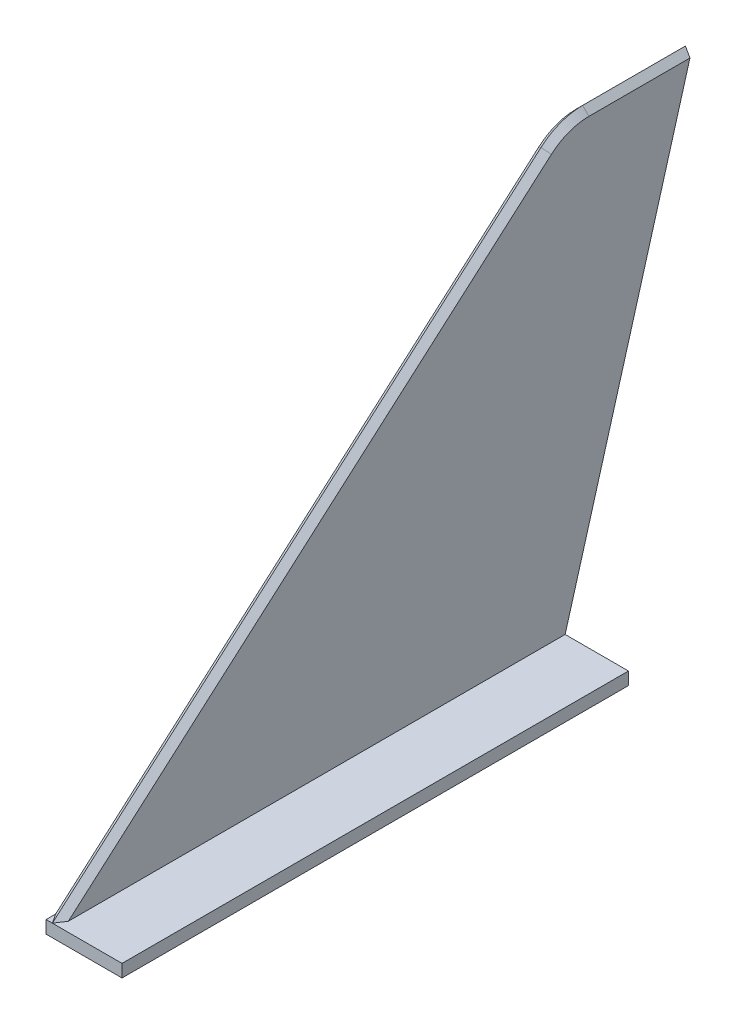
ISO-10303-21;
HEADER;
FILE_DESCRIPTION(('STEP AP214'),'2;1');
FILE_NAME('part.step','',(''),(''),'','','');
FILE_SCHEMA(('AUTOMOTIVE_DESIGN { 1 0 10303 214 1 1 1 1 }'));
ENDSEC;
DATA;
#1=APPLICATION_CONTEXT('core data for automotive mechanical design processes');
#2=APPLICATION_PROTOCOL_DEFINITION('international standard','automotive_design',2000,#1);
#3=PRODUCT_CONTEXT('',#1,'mechanical');
#4=PRODUCT('Part','Part','',(#3));
#5=PRODUCT_RELATED_PRODUCT_CATEGORY('part','',(#4));
#6=PRODUCT_DEFINITION_FORMATION('','',#4);
#7=PRODUCT_DEFINITION_CONTEXT('part definition',#1,'design');
#8=PRODUCT_DEFINITION('design','',#6,#7);
#9=PRODUCT_DEFINITION_SHAPE('','',#8);
#10=(LENGTH_UNIT() NAMED_UNIT(*) SI_UNIT(.MILLI.,.METRE.));
#11=(NAMED_UNIT(*) PLANE_ANGLE_UNIT() SI_UNIT($,.RADIAN.));
#12=(NAMED_UNIT(*) SI_UNIT($,.STERADIAN.) SOLID_ANGLE_UNIT());
#13=UNCERTAINTY_MEASURE_WITH_UNIT(LENGTH_MEASURE(1.E-05),#10,'distance_accuracy_value','');
#14=(GEOMETRIC_REPRESENTATION_CONTEXT(3) GLOBAL_UNCERTAINTY_ASSIGNED_CONTEXT((#13)) GLOBAL_UNIT_ASSIGNED_CONTEXT((#10,
#11,#12)) REPRESENTATION_CONTEXT('',''));
#15=CARTESIAN_POINT('',(0.,0.,0.));
#16=DIRECTION('',(0.,0.,1.));
#17=DIRECTION('',(1.,0.,0.));
#18=AXIS2_PLACEMENT_3D('',#15,#16,#17);
#19=CARTESIAN_POINT('',(1.,70.,-20.));
#20=DIRECTION('',(0.,0.274721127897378,0.961523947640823));
#21=DIRECTION('',(0.,-0.961523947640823,0.274721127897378));
#22=AXIS2_PLACEMENT_3D('',#19,#20,#21);
#23=PLANE('',#22);
#24=DIRECTION('',(0.,0.961523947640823,-0.274721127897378));
#25=VECTOR('',#24,1.);
#26=CARTESIAN_POINT('',(-1.,70.,-20.));
#27=LINE('',#26,#25);
#28=CARTESIAN_POINT('',(-1.,0.,0.));
#29=VERTEX_POINT('',#28);
#30=CARTESIAN_POINT('',(-1.,69.,-19.7142857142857));
#31=VERTEX_POINT('',#30);
#32=EDGE_CURVE('E125',#29,#31,#27,.T.);
#33=ORIENTED_EDGE('',*,*,#32,.T.);
#34=DIRECTION('',(0.693103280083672,0.693103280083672,-0.198029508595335));
#35=VECTOR('',#34,1.);
#36=CARTESIAN_POINT('',(-2.2293831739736,67.7706168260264,-19.3630333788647));
#37=LINE('',#36,#35);
#38=CARTESIAN_POINT('',(0.,70.,-20.));
#39=VERTEX_POINT('',#38);
#40=EDGE_CURVE('E164',#31,#39,#37,.T.);
#41=ORIENTED_EDGE('',*,*,#40,.T.);
#42=DIRECTION('',(-0.693103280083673,0.693103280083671,-0.198029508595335));
#43=VECTOR('',#42,1.);
#44=CARTESIAN_POINT('',(3.19016748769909,66.8098325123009,-19.0885235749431));
#45=LINE('',#44,#43);
#46=CARTESIAN_POINT('',(1.,69.,-19.7142857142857));
#47=VERTEX_POINT('',#46);
#48=EDGE_CURVE('E163',#39,#47,#45,.F.);
#49=ORIENTED_EDGE('',*,*,#48,.T.);
#50=DIRECTION('',(0.,0.961523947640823,-0.274721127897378));
#51=VECTOR('',#50,1.);
#52=CARTESIAN_POINT('',(1.,70.,-20.));
#53=LINE('',#52,#51);
#54=CARTESIAN_POINT('',(1.,0.,0.));
#55=VERTEX_POINT('',#54);
#56=EDGE_CURVE('E126',#55,#47,#53,.T.);
#57=ORIENTED_EDGE('',*,*,#56,.F.);
#58=DIRECTION('',(-1.,0.,0.));
#59=VECTOR('',#58,1.);
#60=CARTESIAN_POINT('',(1.,0.,0.));
#61=LINE('',#60,#59);
#62=EDGE_CURVE('E111',#55,#29,#61,.T.);
#63=ORIENTED_EDGE('',*,*,#62,.T.);
#64=EDGE_LOOP('',(#33,#41,#49,#57,#63));
#65=FACE_BOUND('',#64,.T.);
#66=ADVANCED_FACE('F31',(#65),#23,.F.);
#67=CARTESIAN_POINT('',(1.,60.,-3.75735116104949));
#68=DIRECTION('',(-1.,0.,0.));
#69=DIRECTION('',(0.,0.,1.));
#70=AXIS2_PLACEMENT_3D('',#67,#68,#69);
#71=PLANE('',#70);
#72=ORIENTED_EDGE('',*,*,#56,.T.);
#73=DIRECTION('',(0.,0.,1.));
#74=VECTOR('',#73,1.);
#75=CARTESIAN_POINT('',(1.,69.,-3.75735116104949));
#76=LINE('',#75,#74);
#77=CARTESIAN_POINT('',(1.,69.,-3.75735116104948));
#78=VERTEX_POINT('',#77);
#79=EDGE_CURVE('E11',#47,#78,#76,.T.);
#80=ORIENTED_EDGE('',*,*,#79,.T.);
#81=CARTESIAN_POINT('',(1.,60.,-3.75735116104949));
#82=DIRECTION('',(-1.,0.,0.));
#83=DIRECTION('',(0.,0.,1.));
#84=AXIS2_PLACEMENT_3D('',#81,#82,#83);
#85=CIRCLE('',#84,9.);
#86=CARTESIAN_POINT('',(1.,66.7731902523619,2.16919030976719));
#87=VERTEX_POINT('',#86);
#88=EDGE_CURVE('E39',#78,#87,#85,.F.);
#89=ORIENTED_EDGE('',*,*,#88,.T.);
#90=DIRECTION('',(0.,-0.658504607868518,0.752576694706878));
#91=VECTOR('',#90,1.);
#92=CARTESIAN_POINT('',(1.,66.7731902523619,2.16919030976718));
#93=LINE('',#92,#91);
#94=CARTESIAN_POINT('',(1.,0.,78.4814077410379));
#95=VERTEX_POINT('',#94);
#96=EDGE_CURVE('E156',#87,#95,#93,.T.);
#97=ORIENTED_EDGE('',*,*,#96,.T.);
#98=DIRECTION('',(0.,0.,-1.));
#99=VECTOR('',#98,1.);
#100=CARTESIAN_POINT('',(1.,0.,0.));
#101=LINE('',#100,#99);
#102=EDGE_CURVE('E128',#95,#55,#101,.T.);
#103=ORIENTED_EDGE('',*,*,#102,.T.);
#104=EDGE_LOOP('',(#72,#80,#89,#97,#103));
#105=FACE_BOUND('',#104,.T.);
#106=ADVANCED_FACE('F170',(#105),#71,.F.);
#107=CARTESIAN_POINT('',(-1.,60.,-3.75735116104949));
#108=DIRECTION('',(-1.,0.,0.));
#109=DIRECTION('',(0.,0.,1.));
#110=AXIS2_PLACEMENT_3D('',#107,#108,#109);
#111=PLANE('',#110);
#112=CARTESIAN_POINT('',(-1.,60.,-3.75735116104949));
#113=DIRECTION('',(-1.,0.,0.));
#114=DIRECTION('',(0.,0.,1.));
#115=AXIS2_PLACEMENT_3D('',#112,#113,#114);
#116=CIRCLE('',#115,9.);
#117=CARTESIAN_POINT('',(-1.,66.7731902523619,2.16919030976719));
#118=VERTEX_POINT('',#117);
#119=CARTESIAN_POINT('',(-1.,69.,-3.75735116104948));
#120=VERTEX_POINT('',#119);
#121=EDGE_CURVE('E144',#118,#120,#116,.T.);
#122=ORIENTED_EDGE('',*,*,#121,.T.);
#123=DIRECTION('',(0.,0.,-1.));
#124=VECTOR('',#123,1.);
#125=CARTESIAN_POINT('',(-1.,69.,-20.));
#126=LINE('',#125,#124);
#127=EDGE_CURVE('E133',#120,#31,#126,.T.);
#128=ORIENTED_EDGE('',*,*,#127,.T.);
#129=ORIENTED_EDGE('',*,*,#32,.F.);
#130=DIRECTION('',(0.,1.,0.));
#131=VECTOR('',#130,1.);
#132=CARTESIAN_POINT('',(-1.,-2.,0.));
#133=LINE('',#132,#131);
#134=CARTESIAN_POINT('',(-1.,-2.,0.));
#135=VERTEX_POINT('',#134);
#136=EDGE_CURVE('E108',#135,#29,#133,.T.);
#137=ORIENTED_EDGE('',*,*,#136,.F.);
#138=DIRECTION('',(0.,0.,-1.));
#139=VECTOR('',#138,1.);
#140=CARTESIAN_POINT('',(-1.,-2.,0.));
#141=LINE('',#140,#139);
#142=CARTESIAN_POINT('',(-1.,-2.00000000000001,80.));
#143=VERTEX_POINT('',#142);
#144=EDGE_CURVE('E198',#143,#135,#141,.T.);
#145=ORIENTED_EDGE('',*,*,#144,.F.);
#146=DIRECTION('',(0.,1.,0.));
#147=VECTOR('',#146,1.);
#148=CARTESIAN_POINT('',(-1.,-2.00000000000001,80.));
#149=LINE('',#148,#147);
#150=CARTESIAN_POINT('',(-1.,0.,80.));
#151=VERTEX_POINT('',#150);
#152=EDGE_CURVE('E208',#143,#151,#149,.T.);
#153=ORIENTED_EDGE('',*,*,#152,.T.);
#154=DIRECTION('',(0.,0.,-1.));
#155=VECTOR('',#154,1.);
#156=CARTESIAN_POINT('',(-1.,0.,0.));
#157=LINE('',#156,#155);
#158=CARTESIAN_POINT('',(-1.,0.,78.4814077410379));
#159=VERTEX_POINT('',#158);
#160=EDGE_CURVE('E187',#151,#159,#157,.T.);
#161=ORIENTED_EDGE('',*,*,#160,.T.);
#162=DIRECTION('',(0.,0.658504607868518,-0.752576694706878));
#163=VECTOR('',#162,1.);
#164=CARTESIAN_POINT('',(-1.,66.7731902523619,2.16919030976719));
#165=LINE('',#164,#163);
#166=EDGE_CURVE('E127',#159,#118,#165,.T.);
#167=ORIENTED_EDGE('',*,*,#166,.T.);
#168=EDGE_LOOP('',(#122,#128,#129,#137,#145,#153,#161,#167));
#169=FACE_BOUND('',#168,.T.);
#170=ADVANCED_FACE('F131',(#169),#111,.T.);
#171=CARTESIAN_POINT('',(1.,66.7731902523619,2.16919030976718));
#172=DIRECTION('',(-0.707106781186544,-0.532152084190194,-0.46563307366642));
#173=DIRECTION('',(0.601316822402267,-0.799010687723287,0.));
#174=AXIS2_PLACEMENT_3D('',#171,#172,#173);
#175=PLANE('',#174);
#176=DIRECTION('',(0.549971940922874,0.,-0.835183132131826));
#177=VECTOR('',#176,1.);
#178=CARTESIAN_POINT('',(36.0522838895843,0.,25.2512807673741));
#179=LINE('',#178,#177);
#180=CARTESIAN_POINT('',(0.,0.,80.));
#181=VERTEX_POINT('',#180);
#182=EDGE_CURVE('E157',#95,#181,#179,.F.);
#183=ORIENTED_EDGE('',*,*,#182,.F.);
#184=ORIENTED_EDGE('',*,*,#96,.F.);
#185=DIRECTION('',(0.707106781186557,-0.532152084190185,-0.465633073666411));
#186=VECTOR('',#185,1.);
#187=CARTESIAN_POINT('',(0.,67.5257669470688,2.82769491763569));
#188=LINE('',#187,#186);
#189=CARTESIAN_POINT('',(0.,67.5257669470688,2.82769491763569));
#190=VERTEX_POINT('',#189);
#191=EDGE_CURVE('E134',#190,#87,#188,.T.);
#192=ORIENTED_EDGE('',*,*,#191,.F.);
#193=DIRECTION('',(0.,0.658504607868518,-0.752576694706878));
#194=VECTOR('',#193,1.);
#195=CARTESIAN_POINT('',(0.,0.,80.));
#196=LINE('',#195,#194);
#197=EDGE_CURVE('E138',#181,#190,#196,.T.);
#198=ORIENTED_EDGE('',*,*,#197,.F.);
#199=EDGE_LOOP('',(#183,#184,#192,#198));
#200=FACE_BOUND('',#199,.T.);
#201=ADVANCED_FACE('F173',(#200),#175,.F.);
#202=CARTESIAN_POINT('',(1.,60.,-3.75735116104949));
#203=DIRECTION('',(-1.,0.,0.));
#204=DIRECTION('',(0.,0.,1.));
#205=AXIS2_PLACEMENT_3D('',#202,#203,#204);
#206=CONICAL_SURFACE('',#205,9.,0.785398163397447);
#207=ORIENTED_EDGE('',*,*,#191,.T.);
#208=ORIENTED_EDGE('',*,*,#88,.F.);
#209=DIRECTION('',(0.707106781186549,-0.707106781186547,0.));
#210=VECTOR('',#209,1.);
#211=CARTESIAN_POINT('',(0.,70.,-3.75735116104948));
#212=LINE('',#211,#210);
#213=CARTESIAN_POINT('',(0.,70.,-3.75735116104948));
#214=VERTEX_POINT('',#213);
#215=EDGE_CURVE('E230',#214,#78,#212,.T.);
#216=ORIENTED_EDGE('',*,*,#215,.F.);
#217=CARTESIAN_POINT('',(0.,60.,-3.75735116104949));
#218=DIRECTION('',(-1.,0.,0.));
#219=DIRECTION('',(0.,0.,1.));
#220=AXIS2_PLACEMENT_3D('',#217,#218,#219);
#221=CIRCLE('',#220,10.);
#222=EDGE_CURVE('E227',#190,#214,#221,.T.);
#223=ORIENTED_EDGE('',*,*,#222,.F.);
#224=EDGE_LOOP('',(#207,#208,#216,#223));
#225=FACE_BOUND('',#224,.T.);
#226=ADVANCED_FACE('F236',(#225),#206,.T.);
#227=CARTESIAN_POINT('',(0.,0.,80.));
#228=DIRECTION('',(-0.707106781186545,0.532152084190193,0.465633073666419));
#229=DIRECTION('',(-0.601316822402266,-0.799010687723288,0.));
#230=AXIS2_PLACEMENT_3D('',#227,#228,#229);
#231=PLANE('',#230);
#232=DIRECTION('',(-0.549971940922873,0.,-0.835183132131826));
#233=VECTOR('',#232,1.);
#234=CARTESIAN_POINT('',(0.,0.,80.));
#235=LINE('',#234,#233);
#236=EDGE_CURVE('E154',#181,#159,#235,.T.);
#237=ORIENTED_EDGE('',*,*,#236,.F.);
#238=ORIENTED_EDGE('',*,*,#197,.T.);
#239=DIRECTION('',(0.707106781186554,0.532152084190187,0.465633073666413));
#240=VECTOR('',#239,1.);
#241=CARTESIAN_POINT('',(-1.,66.7731902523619,2.16919030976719));
#242=LINE('',#241,#240);
#243=EDGE_CURVE('E224',#118,#190,#242,.T.);
#244=ORIENTED_EDGE('',*,*,#243,.F.);
#245=ORIENTED_EDGE('',*,*,#166,.F.);
#246=EDGE_LOOP('',(#237,#238,#244,#245));
#247=FACE_BOUND('',#246,.T.);
#248=ADVANCED_FACE('F234',(#247),#231,.T.);
#249=CARTESIAN_POINT('',(1.,69.,-3.75735116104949));
#250=DIRECTION('',(-0.707106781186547,-0.707106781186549,0.));
#251=DIRECTION('',(0.707106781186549,-0.707106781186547,0.));
#252=AXIS2_PLACEMENT_3D('',#249,#250,#251);
#253=PLANE('',#252);
#254=ORIENTED_EDGE('',*,*,#79,.F.);
#255=ORIENTED_EDGE('',*,*,#48,.F.);
#256=DIRECTION('',(0.,0.,-1.));
#257=VECTOR('',#256,1.);
#258=CARTESIAN_POINT('',(0.,70.,-3.75735116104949));
#259=LINE('',#258,#257);
#260=EDGE_CURVE('E221',#214,#39,#259,.T.);
#261=ORIENTED_EDGE('',*,*,#260,.F.);
#262=ORIENTED_EDGE('',*,*,#215,.T.);
#263=EDGE_LOOP('',(#254,#255,#261,#262));
#264=FACE_BOUND('',#263,.T.);
#265=ADVANCED_FACE('F245',(#264),#253,.F.);
#266=CARTESIAN_POINT('',(0.,60.,-3.75735116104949));
#267=DIRECTION('',(1.,0.,0.));
#268=DIRECTION('',(0.,0.,-1.));
#269=AXIS2_PLACEMENT_3D('',#266,#267,#268);
#270=CONICAL_SURFACE('',#269,10.,0.785398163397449);
#271=ORIENTED_EDGE('',*,*,#243,.T.);
#272=ORIENTED_EDGE('',*,*,#222,.T.);
#273=DIRECTION('',(0.707106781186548,0.707106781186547,0.));
#274=VECTOR('',#273,1.);
#275=CARTESIAN_POINT('',(-1.,69.,-3.75735116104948));
#276=LINE('',#275,#274);
#277=EDGE_CURVE('E119',#120,#214,#276,.T.);
#278=ORIENTED_EDGE('',*,*,#277,.F.);
#279=ORIENTED_EDGE('',*,*,#121,.F.);
#280=EDGE_LOOP('',(#271,#272,#278,#279));
#281=FACE_BOUND('',#280,.T.);
#282=ADVANCED_FACE('F240',(#281),#270,.T.);
#283=CARTESIAN_POINT('',(0.,70.,-3.75735116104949));
#284=DIRECTION('',(-0.707106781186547,0.707106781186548,0.));
#285=DIRECTION('',(-0.707106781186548,-0.707106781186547,0.));
#286=AXIS2_PLACEMENT_3D('',#283,#284,#285);
#287=PLANE('',#286);
#288=ORIENTED_EDGE('',*,*,#40,.F.);
#289=ORIENTED_EDGE('',*,*,#127,.F.);
#290=ORIENTED_EDGE('',*,*,#277,.T.);
#291=ORIENTED_EDGE('',*,*,#260,.T.);
#292=EDGE_LOOP('',(#288,#289,#290,#291));
#293=FACE_BOUND('',#292,.T.);
#294=ADVANCED_FACE('F242',(#293),#287,.T.);
#295=CARTESIAN_POINT('',(-1.,0.,80.));
#296=DIRECTION('',(0.,1.,0.));
#297=DIRECTION('',(0.,0.,1.));
#298=AXIS2_PLACEMENT_3D('',#295,#296,#297);
#299=PLANE('',#298);
#300=DIRECTION('',(-1.,0.,0.));
#301=VECTOR('',#300,1.);
#302=CARTESIAN_POINT('',(-1.,0.,80.));
#303=LINE('',#302,#301);
#304=EDGE_CURVE('E185',#181,#151,#303,.T.);
#305=ORIENTED_EDGE('',*,*,#304,.F.);
#306=ORIENTED_EDGE('',*,*,#236,.T.);
#307=ORIENTED_EDGE('',*,*,#160,.F.);
#308=EDGE_LOOP('',(#305,#306,#307));
#309=FACE_BOUND('',#308,.T.);
#310=ADVANCED_FACE('F186',(#309),#299,.T.);
#311=CARTESIAN_POINT('',(-1.,-2.,0.));
#312=DIRECTION('',(0.,0.,1.));
#313=DIRECTION('',(0.,-1.,0.));
#314=AXIS2_PLACEMENT_3D('',#311,#312,#313);
#315=PLANE('',#314);
#316=ORIENTED_EDGE('',*,*,#62,.F.);
#317=DIRECTION('',(1.,0.,0.));
#318=VECTOR('',#317,1.);
#319=CARTESIAN_POINT('',(-1.,0.,0.));
#320=LINE('',#319,#318);
#321=CARTESIAN_POINT('',(11.,0.,0.));
#322=VERTEX_POINT('',#321);
#323=EDGE_CURVE('E215',#55,#322,#320,.T.);
#324=ORIENTED_EDGE('',*,*,#323,.T.);
#325=DIRECTION('',(0.,1.,0.));
#326=VECTOR('',#325,1.);
#327=CARTESIAN_POINT('',(11.,-2.,0.));
#328=LINE('',#327,#326);
#329=CARTESIAN_POINT('',(11.,-2.,0.));
#330=VERTEX_POINT('',#329);
#331=EDGE_CURVE('E120',#330,#322,#328,.T.);
#332=ORIENTED_EDGE('',*,*,#331,.F.);
#333=DIRECTION('',(1.,0.,0.));
#334=VECTOR('',#333,1.);
#335=CARTESIAN_POINT('',(-1.,-2.,0.));
#336=LINE('',#335,#334);
#337=EDGE_CURVE('E114',#135,#330,#336,.T.);
#338=ORIENTED_EDGE('',*,*,#337,.F.);
#339=ORIENTED_EDGE('',*,*,#136,.T.);
#340=EDGE_LOOP('',(#316,#324,#332,#338,#339));
#341=FACE_BOUND('',#340,.T.);
#342=ADVANCED_FACE('F110',(#341),#315,.F.);
#343=CARTESIAN_POINT('',(11.,-2.,0.));
#344=DIRECTION('',(-1.,0.,0.));
#345=DIRECTION('',(0.,0.,1.));
#346=AXIS2_PLACEMENT_3D('',#343,#344,#345);
#347=PLANE('',#346);
#348=DIRECTION('',(0.,0.,1.));
#349=VECTOR('',#348,1.);
#350=CARTESIAN_POINT('',(11.,0.,0.));
#351=LINE('',#350,#349);
#352=CARTESIAN_POINT('',(11.,0.,80.));
#353=VERTEX_POINT('',#352);
#354=EDGE_CURVE('E191',#322,#353,#351,.T.);
#355=ORIENTED_EDGE('',*,*,#354,.T.);
#356=DIRECTION('',(0.,1.,0.));
#357=VECTOR('',#356,1.);
#358=CARTESIAN_POINT('',(11.,-2.00000000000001,80.));
#359=LINE('',#358,#357);
#360=CARTESIAN_POINT('',(11.,-2.00000000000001,80.));
#361=VERTEX_POINT('',#360);
#362=EDGE_CURVE('E197',#361,#353,#359,.T.);
#363=ORIENTED_EDGE('',*,*,#362,.F.);
#364=DIRECTION('',(0.,0.,1.));
#365=VECTOR('',#364,1.);
#366=CARTESIAN_POINT('',(11.,-2.,0.));
#367=LINE('',#366,#365);
#368=EDGE_CURVE('E204',#330,#361,#367,.T.);
#369=ORIENTED_EDGE('',*,*,#368,.F.);
#370=ORIENTED_EDGE('',*,*,#331,.T.);
#371=EDGE_LOOP('',(#355,#363,#369,#370));
#372=FACE_BOUND('',#371,.T.);
#373=ADVANCED_FACE('F297',(#372),#347,.F.);
#374=CARTESIAN_POINT('',(-1.,-2.00000000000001,80.));
#375=DIRECTION('',(0.,0.,-1.));
#376=DIRECTION('',(0.,1.,0.));
#377=AXIS2_PLACEMENT_3D('',#374,#375,#376);
#378=PLANE('',#377);
#379=EDGE_CURVE('E182',#353,#181,#303,.T.);
#380=ORIENTED_EDGE('',*,*,#379,.T.);
#381=ORIENTED_EDGE('',*,*,#304,.T.);
#382=ORIENTED_EDGE('',*,*,#152,.F.);
#383=DIRECTION('',(-1.,0.,0.));
#384=VECTOR('',#383,1.);
#385=CARTESIAN_POINT('',(-1.,-2.00000000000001,80.));
#386=LINE('',#385,#384);
#387=EDGE_CURVE('E206',#361,#143,#386,.T.);
#388=ORIENTED_EDGE('',*,*,#387,.F.);
#389=ORIENTED_EDGE('',*,*,#362,.T.);
#390=EDGE_LOOP('',(#380,#381,#382,#388,#389));
#391=FACE_BOUND('',#390,.T.);
#392=ADVANCED_FACE('F194',(#391),#378,.F.);
#393=CARTESIAN_POINT('',(-1.,-2.00000000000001,80.));
#394=DIRECTION('',(0.,1.,0.));
#395=DIRECTION('',(0.,0.,1.));
#396=AXIS2_PLACEMENT_3D('',#393,#394,#395);
#397=PLANE('',#396);
#398=ORIENTED_EDGE('',*,*,#144,.T.);
#399=ORIENTED_EDGE('',*,*,#337,.T.);
#400=ORIENTED_EDGE('',*,*,#368,.T.);
#401=ORIENTED_EDGE('',*,*,#387,.T.);
#402=EDGE_LOOP('',(#398,#399,#400,#401));
#403=FACE_BOUND('',#402,.T.);
#404=ADVANCED_FACE('F315',(#403),#397,.F.);
#405=ORIENTED_EDGE('',*,*,#102,.F.);
#406=ORIENTED_EDGE('',*,*,#182,.T.);
#407=ORIENTED_EDGE('',*,*,#379,.F.);
#408=ORIENTED_EDGE('',*,*,#354,.F.);
#409=ORIENTED_EDGE('',*,*,#323,.F.);
#410=EDGE_LOOP('',(#405,#406,#407,#408,#409));
#411=FACE_BOUND('',#410,.T.);
#412=ADVANCED_FACE('F179',(#411),#299,.T.);
#413=CLOSED_SHELL('',(#66,#106,#170,#201,#226,#248,#265,#282,#294,#310,#342,#373,#392,#404,#412));
#414=MANIFOLD_SOLID_BREP('B2',#413);
#415=ADVANCED_BREP_SHAPE_REPRESENTATION('',(#18,#414),#14);
#416=SHAPE_DEFINITION_REPRESENTATION(#9,#415);
ENDSEC;
END-ISO-10303-21;
